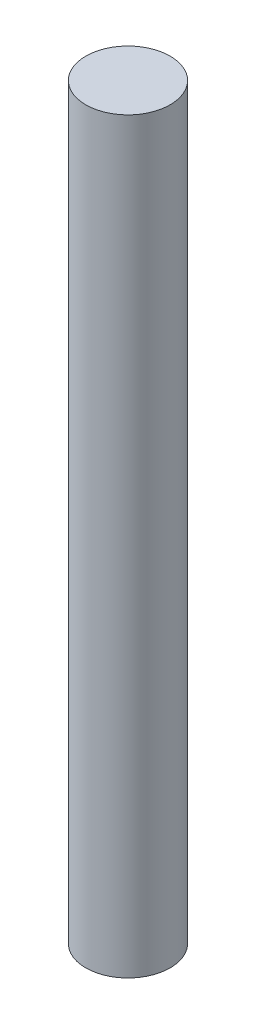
ISO-10303-21;
HEADER;
FILE_DESCRIPTION(('STEP AP214'),'2;1');
FILE_NAME('part.step','',(''),(''),'','','');
FILE_SCHEMA(('AUTOMOTIVE_DESIGN { 1 0 10303 214 1 1 1 1 }'));
ENDSEC;
DATA;
#1=APPLICATION_CONTEXT('core data for automotive mechanical design processes');
#2=APPLICATION_PROTOCOL_DEFINITION('international standard','automotive_design',2000,#1);
#3=PRODUCT_CONTEXT('',#1,'mechanical');
#4=PRODUCT('Part','Part','',(#3));
#5=PRODUCT_RELATED_PRODUCT_CATEGORY('part','',(#4));
#6=PRODUCT_DEFINITION_FORMATION('','',#4);
#7=PRODUCT_DEFINITION_CONTEXT('part definition',#1,'design');
#8=PRODUCT_DEFINITION('design','',#6,#7);
#9=PRODUCT_DEFINITION_SHAPE('','',#8);
#10=(LENGTH_UNIT() NAMED_UNIT(*) SI_UNIT(.MILLI.,.METRE.));
#11=(NAMED_UNIT(*) PLANE_ANGLE_UNIT() SI_UNIT($,.RADIAN.));
#12=(NAMED_UNIT(*) SI_UNIT($,.STERADIAN.) SOLID_ANGLE_UNIT());
#13=UNCERTAINTY_MEASURE_WITH_UNIT(LENGTH_MEASURE(1.E-05),#10,'distance_accuracy_value','');
#14=(GEOMETRIC_REPRESENTATION_CONTEXT(3) GLOBAL_UNCERTAINTY_ASSIGNED_CONTEXT((#13)) GLOBAL_UNIT_ASSIGNED_CONTEXT((#10,
#11,#12)) REPRESENTATION_CONTEXT('',''));
#15=CARTESIAN_POINT('',(0.,0.,0.));
#16=DIRECTION('',(0.,0.,1.));
#17=DIRECTION('',(1.,0.,0.));
#18=AXIS2_PLACEMENT_3D('',#15,#16,#17);
#19=CARTESIAN_POINT('',(0.,7.14375,0.));
#20=DIRECTION('',(0.,-1.,0.));
#21=DIRECTION('',(0.,0.,-1.));
#22=AXIS2_PLACEMENT_3D('',#19,#20,#21);
#23=CYLINDRICAL_SURFACE('',#22,0.80645);
#24=CARTESIAN_POINT('',(0.,7.14375,0.));
#25=DIRECTION('',(0.,1.,0.));
#26=DIRECTION('',(0.,0.,1.));
#27=AXIS2_PLACEMENT_3D('',#24,#25,#26);
#28=CIRCLE('',#27,0.80645);
#29=CARTESIAN_POINT('',(0.,7.14375,0.80645));
#30=VERTEX_POINT('',#29);
#31=EDGE_CURVE('E10',#30,#30,#28,.T.);
#32=ORIENTED_EDGE('',*,*,#31,.F.);
#33=EDGE_LOOP('',(#32));
#34=FACE_BOUND('',#33,.T.);
#35=CARTESIAN_POINT('',(0.,-7.14375,0.));
#36=DIRECTION('',(0.,1.,0.));
#37=DIRECTION('',(0.,0.,1.));
#38=AXIS2_PLACEMENT_3D('',#35,#36,#37);
#39=CIRCLE('',#38,0.80645);
#40=CARTESIAN_POINT('',(0.,-7.14375,0.80645));
#41=VERTEX_POINT('',#40);
#42=EDGE_CURVE('E36',#41,#41,#39,.T.);
#43=ORIENTED_EDGE('',*,*,#42,.T.);
#44=EDGE_LOOP('',(#43));
#45=FACE_BOUND('',#44,.T.);
#46=ADVANCED_FACE('F33',(#34,#45),#23,.T.);
#47=CARTESIAN_POINT('',(0.,7.14375,0.));
#48=DIRECTION('',(0.,1.,0.));
#49=DIRECTION('',(0.,0.,1.));
#50=AXIS2_PLACEMENT_3D('',#47,#48,#49);
#51=PLANE('',#50);
#52=ORIENTED_EDGE('',*,*,#31,.T.);
#53=EDGE_LOOP('',(#52));
#54=FACE_BOUND('',#53,.T.);
#55=ADVANCED_FACE('F48',(#54),#51,.T.);
#56=CARTESIAN_POINT('',(0.,-7.14375,0.));
#57=DIRECTION('',(0.,1.,0.));
#58=DIRECTION('',(0.,0.,1.));
#59=AXIS2_PLACEMENT_3D('',#56,#57,#58);
#60=PLANE('',#59);
#61=ORIENTED_EDGE('',*,*,#42,.F.);
#62=EDGE_LOOP('',(#61));
#63=FACE_BOUND('',#62,.T.);
#64=ADVANCED_FACE('F46',(#63),#60,.F.);
#65=CLOSED_SHELL('',(#46,#55,#64));
#66=MANIFOLD_SOLID_BREP('B2',#65);
#67=ADVANCED_BREP_SHAPE_REPRESENTATION('',(#18,#66),#14);
#68=SHAPE_DEFINITION_REPRESENTATION(#9,#67);
ENDSEC;
END-ISO-10303-21;
